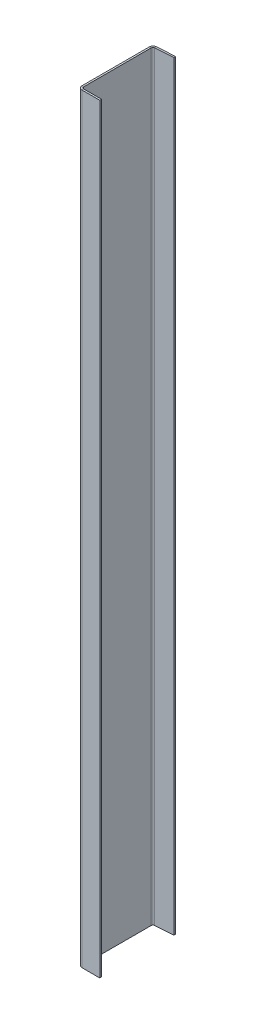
ISO-10303-21;
HEADER;
FILE_DESCRIPTION(('STEP AP214'),'2;1');
FILE_NAME('part.step','',(''),(''),'','','');
FILE_SCHEMA(('AUTOMOTIVE_DESIGN { 1 0 10303 214 1 1 1 1 }'));
ENDSEC;
DATA;
#1=APPLICATION_CONTEXT('core data for automotive mechanical design processes');
#2=APPLICATION_PROTOCOL_DEFINITION('international standard','automotive_design',2000,#1);
#3=PRODUCT_CONTEXT('',#1,'mechanical');
#4=PRODUCT('Part','Part','',(#3));
#5=PRODUCT_RELATED_PRODUCT_CATEGORY('part','',(#4));
#6=PRODUCT_DEFINITION_FORMATION('','',#4);
#7=PRODUCT_DEFINITION_CONTEXT('part definition',#1,'design');
#8=PRODUCT_DEFINITION('design','',#6,#7);
#9=PRODUCT_DEFINITION_SHAPE('','',#8);
#10=(LENGTH_UNIT() NAMED_UNIT(*) SI_UNIT(.MILLI.,.METRE.));
#11=(NAMED_UNIT(*) PLANE_ANGLE_UNIT() SI_UNIT($,.RADIAN.));
#12=(NAMED_UNIT(*) SI_UNIT($,.STERADIAN.) SOLID_ANGLE_UNIT());
#13=UNCERTAINTY_MEASURE_WITH_UNIT(LENGTH_MEASURE(1.E-05),#10,'distance_accuracy_value','');
#14=(GEOMETRIC_REPRESENTATION_CONTEXT(3) GLOBAL_UNCERTAINTY_ASSIGNED_CONTEXT((#13)) GLOBAL_UNIT_ASSIGNED_CONTEXT((#10,
#11,#12)) REPRESENTATION_CONTEXT('',''));
#15=CARTESIAN_POINT('',(0.,0.,0.));
#16=DIRECTION('',(0.,0.,1.));
#17=DIRECTION('',(1.,0.,0.));
#18=AXIS2_PLACEMENT_3D('',#15,#16,#17);
#19=CARTESIAN_POINT('',(5.99520433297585E-12,2692.40000000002,-12.6999999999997));
#20=DIRECTION('',(0.,1.00000000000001,0.));
#21=DIRECTION('',(0.,0.,1.));
#22=AXIS2_PLACEMENT_3D('',#19,#20,#21);
#23=PLANE('',#22);
#24=DIRECTION('',(1.,0.,0.));
#25=VECTOR('',#24,1.);
#26=CARTESIAN_POINT('',(5.99520433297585E-12,2692.40000000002,-12.6999999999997));
#27=LINE('',#26,#25);
#28=CARTESIAN_POINT('',(5.99520433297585E-12,2692.40000000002,-12.6999999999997));
#29=VERTEX_POINT('',#28);
#30=CARTESIAN_POINT('',(6.35000000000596,2692.40000000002,-12.6999999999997));
#31=VERTEX_POINT('',#30);
#32=EDGE_CURVE('E11',#29,#31,#27,.T.);
#33=ORIENTED_EDGE('',*,*,#32,.F.);
#34=CARTESIAN_POINT('',(12.7000000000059,2692.40000000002,-12.6999999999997));
#35=DIRECTION('',(0.,1.00000000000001,0.));
#36=DIRECTION('',(0.,0.,1.));
#37=AXIS2_PLACEMENT_3D('',#34,#35,#36);
#38=CIRCLE('',#37,12.7);
#39=CARTESIAN_POINT('',(12.700000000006,2692.40000000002,3.3133218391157E-13));
#40=VERTEX_POINT('',#39);
#41=EDGE_CURVE('E246',#40,#29,#38,.F.);
#42=ORIENTED_EDGE('',*,*,#41,.F.);
#43=DIRECTION('',(0.,0.,1.));
#44=VECTOR('',#43,1.);
#45=CARTESIAN_POINT('',(12.700000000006,2692.40000000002,-6.34999999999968));
#46=LINE('',#45,#44);
#47=CARTESIAN_POINT('',(12.700000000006,2692.40000000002,-6.34999999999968));
#48=VERTEX_POINT('',#47);
#49=EDGE_CURVE('E44',#48,#40,#46,.T.);
#50=ORIENTED_EDGE('',*,*,#49,.F.);
#51=CARTESIAN_POINT('',(12.7000000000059,2692.40000000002,-12.6999999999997));
#52=DIRECTION('',(0.,1.00000000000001,0.));
#53=DIRECTION('',(1.,0.,0.));
#54=AXIS2_PLACEMENT_3D('',#51,#52,#53);
#55=CIRCLE('',#54,6.35);
#56=EDGE_CURVE('E145',#48,#31,#55,.F.);
#57=ORIENTED_EDGE('',*,*,#56,.T.);
#58=EDGE_LOOP('',(#33,#42,#50,#57));
#59=FACE_BOUND('',#58,.T.);
#60=ADVANCED_FACE('F36',(#59),#23,.T.);
#61=CARTESIAN_POINT('',(12.700000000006,2692.40000000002,-6.34999999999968));
#62=DIRECTION('',(0.,1.00000000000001,0.));
#63=DIRECTION('',(0.,0.,1.));
#64=AXIS2_PLACEMENT_3D('',#61,#62,#63);
#65=PLANE('',#64);
#66=DIRECTION('',(0.,0.,-1.));
#67=VECTOR('',#66,1.);
#68=CARTESIAN_POINT('',(5.99520433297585E-12,2692.40000000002,3.35668992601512E-13));
#69=LINE('',#68,#67);
#70=CARTESIAN_POINT('',(5.99520433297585E-12,2692.40000000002,-251.682058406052));
#71=VERTEX_POINT('',#70);
#72=EDGE_CURVE('E139',#29,#71,#69,.T.);
#73=ORIENTED_EDGE('',*,*,#72,.F.);
#74=ORIENTED_EDGE('',*,*,#32,.T.);
#75=DIRECTION('',(0.,0.,-1.));
#76=VECTOR('',#75,1.);
#77=CARTESIAN_POINT('',(6.35000000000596,2692.40000000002,3.33717428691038E-13));
#78=LINE('',#77,#76);
#79=CARTESIAN_POINT('',(6.35000000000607,2692.40000000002,-251.682058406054));
#80=VERTEX_POINT('',#79);
#81=EDGE_CURVE('E136',#31,#80,#78,.T.);
#82=ORIENTED_EDGE('',*,*,#81,.T.);
#83=DIRECTION('',(-1.,0.,0.));
#84=VECTOR('',#83,1.);
#85=CARTESIAN_POINT('',(6.35000000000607,2692.40000000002,-251.682058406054));
#86=LINE('',#85,#84);
#87=EDGE_CURVE('E227',#80,#71,#86,.T.);
#88=ORIENTED_EDGE('',*,*,#87,.T.);
#89=EDGE_LOOP('',(#73,#74,#82,#88));
#90=FACE_BOUND('',#89,.T.);
#91=ADVANCED_FACE('F134',(#90),#65,.T.);
#92=CARTESIAN_POINT('',(12.7,0.,0.));
#93=DIRECTION('',(0.,-1.00000000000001,0.));
#94=DIRECTION('',(0.,0.,-1.));
#95=AXIS2_PLACEMENT_3D('',#92,#93,#94);
#96=PLANE('',#95);
#97=DIRECTION('',(0.,0.,-1.));
#98=VECTOR('',#97,1.);
#99=CARTESIAN_POINT('',(12.7,0.,0.));
#100=LINE('',#99,#98);
#101=CARTESIAN_POINT('',(12.7,0.,0.));
#102=VERTEX_POINT('',#101);
#103=CARTESIAN_POINT('',(12.7,0.,-6.35000000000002));
#104=VERTEX_POINT('',#103);
#105=EDGE_CURVE('E232',#102,#104,#100,.T.);
#106=ORIENTED_EDGE('',*,*,#105,.F.);
#107=CARTESIAN_POINT('',(12.6999999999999,0.,-12.7));
#108=DIRECTION('',(0.,1.00000000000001,0.));
#109=DIRECTION('',(0.,0.,1.));
#110=AXIS2_PLACEMENT_3D('',#107,#108,#109);
#111=CIRCLE('',#110,12.7);
#112=CARTESIAN_POINT('',(0.,0.,-12.7));
#113=VERTEX_POINT('',#112);
#114=EDGE_CURVE('E184',#102,#113,#111,.F.);
#115=ORIENTED_EDGE('',*,*,#114,.T.);
#116=DIRECTION('',(-1.,0.,0.));
#117=VECTOR('',#116,1.);
#118=CARTESIAN_POINT('',(6.34999999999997,0.,-12.7));
#119=LINE('',#118,#117);
#120=CARTESIAN_POINT('',(6.34999999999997,0.,-12.7));
#121=VERTEX_POINT('',#120);
#122=EDGE_CURVE('E230',#121,#113,#119,.T.);
#123=ORIENTED_EDGE('',*,*,#122,.F.);
#124=CARTESIAN_POINT('',(12.6999999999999,0.,-12.7));
#125=DIRECTION('',(0.,1.00000000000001,0.));
#126=DIRECTION('',(1.,0.,0.));
#127=AXIS2_PLACEMENT_3D('',#124,#125,#126);
#128=CIRCLE('',#127,6.35);
#129=EDGE_CURVE('E157',#104,#121,#128,.F.);
#130=ORIENTED_EDGE('',*,*,#129,.F.);
#131=EDGE_LOOP('',(#106,#115,#123,#130));
#132=FACE_BOUND('',#131,.T.);
#133=ADVANCED_FACE('F284',(#132),#96,.T.);
#134=CARTESIAN_POINT('',(6.34999999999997,0.,-12.7));
#135=DIRECTION('',(0.,-1.00000000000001,0.));
#136=DIRECTION('',(0.,0.,-1.));
#137=AXIS2_PLACEMENT_3D('',#134,#135,#136);
#138=PLANE('',#137);
#139=DIRECTION('',(-1.,0.,0.));
#140=VECTOR('',#139,1.);
#141=CARTESIAN_POINT('',(76.2,0.,0.));
#142=LINE('',#141,#140);
#143=CARTESIAN_POINT('',(76.2,0.,0.));
#144=VERTEX_POINT('',#143);
#145=EDGE_CURVE('E187',#144,#102,#142,.T.);
#146=ORIENTED_EDGE('',*,*,#145,.T.);
#147=ORIENTED_EDGE('',*,*,#105,.T.);
#148=DIRECTION('',(-1.,0.,0.));
#149=VECTOR('',#148,1.);
#150=CARTESIAN_POINT('',(76.1999999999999,0.,-6.34999999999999));
#151=LINE('',#150,#149);
#152=CARTESIAN_POINT('',(76.1999999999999,0.,-6.34999999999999));
#153=VERTEX_POINT('',#152);
#154=EDGE_CURVE('E193',#153,#104,#151,.T.);
#155=ORIENTED_EDGE('',*,*,#154,.F.);
#156=DIRECTION('',(0.,0.,1.));
#157=VECTOR('',#156,1.);
#158=CARTESIAN_POINT('',(76.1999999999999,0.,-6.34999999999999));
#159=LINE('',#158,#157);
#160=EDGE_CURVE('E190',#153,#144,#159,.T.);
#161=ORIENTED_EDGE('',*,*,#160,.T.);
#162=EDGE_LOOP('',(#146,#147,#155,#161));
#163=FACE_BOUND('',#162,.T.);
#164=ADVANCED_FACE('F287',(#163),#138,.T.);
#165=CARTESIAN_POINT('',(11.8140927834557,2692.40000000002,-264.351121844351));
#166=DIRECTION('',(0.,1.00000000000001,0.));
#167=DIRECTION('',(0.,0.,1.));
#168=AXIS2_PLACEMENT_3D('',#165,#166,#167);
#169=PLANE('',#168);
#170=DIRECTION('',(0.0697564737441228,0.,0.997564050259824));
#171=VECTOR('',#170,1.);
#172=CARTESIAN_POINT('',(11.8140927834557,2692.40000000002,-264.351121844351));
#173=LINE('',#172,#171);
#174=CARTESIAN_POINT('',(11.8140927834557,2692.40000000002,-264.351121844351));
#175=VERTEX_POINT('',#174);
#176=CARTESIAN_POINT('',(12.2570463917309,2692.40000000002,-258.016590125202));
#177=VERTEX_POINT('',#176);
#178=EDGE_CURVE('E52',#175,#177,#173,.T.);
#179=ORIENTED_EDGE('',*,*,#178,.F.);
#180=CARTESIAN_POINT('',(12.700000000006,2692.40000000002,-251.682058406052));
#181=DIRECTION('',(0.,1.00000000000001,0.));
#182=DIRECTION('',(0.,0.,1.));
#183=AXIS2_PLACEMENT_3D('',#180,#181,#182);
#184=CIRCLE('',#183,12.7);
#185=EDGE_CURVE('E256',#71,#175,#184,.F.);
#186=ORIENTED_EDGE('',*,*,#185,.F.);
#187=ORIENTED_EDGE('',*,*,#87,.F.);
#188=CARTESIAN_POINT('',(12.700000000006,2692.40000000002,-251.682058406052));
#189=DIRECTION('',(0.,1.00000000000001,0.));
#190=DIRECTION('',(1.,0.,0.));
#191=AXIS2_PLACEMENT_3D('',#188,#189,#190);
#192=CIRCLE('',#191,6.35);
#193=EDGE_CURVE('E165',#80,#177,#192,.F.);
#194=ORIENTED_EDGE('',*,*,#193,.T.);
#195=EDGE_LOOP('',(#179,#186,#187,#194));
#196=FACE_BOUND('',#195,.T.);
#197=ADVANCED_FACE('F279',(#196),#169,.T.);
#198=CARTESIAN_POINT('',(6.35000000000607,2692.40000000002,-251.682058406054));
#199=DIRECTION('',(0.,1.00000000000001,0.));
#200=DIRECTION('',(0.,0.,1.));
#201=AXIS2_PLACEMENT_3D('',#198,#199,#200);
#202=PLANE('',#201);
#203=DIRECTION('',(0.997564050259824,0.,-0.0697564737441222));
#204=VECTOR('',#203,1.);
#205=CARTESIAN_POINT('',(5.99520433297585E-12,2692.40000000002,-263.525));
#206=LINE('',#205,#204);
#207=CARTESIAN_POINT('',(76.0143806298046,2692.40000000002,-268.840443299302));
#208=VERTEX_POINT('',#207);
#209=EDGE_CURVE('E259',#175,#208,#206,.T.);
#210=ORIENTED_EDGE('',*,*,#209,.F.);
#211=ORIENTED_EDGE('',*,*,#178,.T.);
#212=DIRECTION('',(0.997564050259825,0.,-0.0697564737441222));
#213=VECTOR('',#212,1.);
#214=CARTESIAN_POINT('',(0.442953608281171,2692.40000000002,-257.19046828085));
#215=LINE('',#214,#213);
#216=CARTESIAN_POINT('',(76.4573342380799,2692.40000000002,-262.505911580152));
#217=VERTEX_POINT('',#216);
#218=EDGE_CURVE('E106',#177,#217,#215,.T.);
#219=ORIENTED_EDGE('',*,*,#218,.T.);
#220=DIRECTION('',(0.0697564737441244,0.,0.997564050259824));
#221=VECTOR('',#220,1.);
#222=CARTESIAN_POINT('',(76.0143806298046,2692.40000000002,-268.840443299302));
#223=LINE('',#222,#221);
#224=EDGE_CURVE('E262',#208,#217,#223,.T.);
#225=ORIENTED_EDGE('',*,*,#224,.F.);
#226=EDGE_LOOP('',(#210,#211,#219,#225));
#227=FACE_BOUND('',#226,.T.);
#228=ADVANCED_FACE('F268',(#227),#202,.T.);
#229=CARTESIAN_POINT('',(0.,0.,-251.682058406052));
#230=DIRECTION('',(0.,-1.00000000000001,0.));
#231=DIRECTION('',(0.,0.,-1.));
#232=AXIS2_PLACEMENT_3D('',#229,#230,#231);
#233=PLANE('',#232);
#234=DIRECTION('',(1.,0.,0.));
#235=VECTOR('',#234,1.);
#236=CARTESIAN_POINT('',(0.,0.,-251.682058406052));
#237=LINE('',#236,#235);
#238=CARTESIAN_POINT('',(0.,0.,-251.682058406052));
#239=VERTEX_POINT('',#238);
#240=CARTESIAN_POINT('',(6.35000000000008,0.,-251.682058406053));
#241=VERTEX_POINT('',#240);
#242=EDGE_CURVE('E93',#239,#241,#237,.T.);
#243=ORIENTED_EDGE('',*,*,#242,.F.);
#244=CARTESIAN_POINT('',(12.7,0.,-251.682058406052));
#245=DIRECTION('',(0.,1.00000000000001,0.));
#246=DIRECTION('',(0.,0.,1.));
#247=AXIS2_PLACEMENT_3D('',#244,#245,#246);
#248=CIRCLE('',#247,12.7);
#249=CARTESIAN_POINT('',(11.8140927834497,0.,-264.351121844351));
#250=VERTEX_POINT('',#249);
#251=EDGE_CURVE('E180',#239,#250,#248,.F.);
#252=ORIENTED_EDGE('',*,*,#251,.T.);
#253=DIRECTION('',(-0.0697564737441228,0.,-0.997564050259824));
#254=VECTOR('',#253,1.);
#255=CARTESIAN_POINT('',(12.2570463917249,0.,-258.016590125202));
#256=LINE('',#255,#254);
#257=CARTESIAN_POINT('',(12.2570463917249,0.,-258.016590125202));
#258=VERTEX_POINT('',#257);
#259=EDGE_CURVE('E100',#258,#250,#256,.T.);
#260=ORIENTED_EDGE('',*,*,#259,.F.);
#261=CARTESIAN_POINT('',(12.7,0.,-251.682058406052));
#262=DIRECTION('',(0.,1.00000000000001,0.));
#263=DIRECTION('',(1.,0.,0.));
#264=AXIS2_PLACEMENT_3D('',#261,#262,#263);
#265=CIRCLE('',#264,6.35);
#266=EDGE_CURVE('E199',#241,#258,#265,.F.);
#267=ORIENTED_EDGE('',*,*,#266,.F.);
#268=EDGE_LOOP('',(#243,#252,#260,#267));
#269=FACE_BOUND('',#268,.T.);
#270=ADVANCED_FACE('F316',(#269),#233,.T.);
#271=CARTESIAN_POINT('',(12.2570463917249,0.,-258.016590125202));
#272=DIRECTION('',(0.,-1.00000000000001,0.));
#273=DIRECTION('',(0.,0.,-1.));
#274=AXIS2_PLACEMENT_3D('',#271,#272,#273);
#275=PLANE('',#274);
#276=DIRECTION('',(0.,0.,-1.));
#277=VECTOR('',#276,1.);
#278=CARTESIAN_POINT('',(0.,0.,0.));
#279=LINE('',#278,#277);
#280=EDGE_CURVE('E182',#113,#239,#279,.T.);
#281=ORIENTED_EDGE('',*,*,#280,.T.);
#282=ORIENTED_EDGE('',*,*,#242,.T.);
#283=DIRECTION('',(0.,0.,-1.));
#284=VECTOR('',#283,1.);
#285=CARTESIAN_POINT('',(6.34999999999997,0.,0.));
#286=LINE('',#285,#284);
#287=EDGE_CURVE('E197',#121,#241,#286,.T.);
#288=ORIENTED_EDGE('',*,*,#287,.F.);
#289=ORIENTED_EDGE('',*,*,#122,.T.);
#290=EDGE_LOOP('',(#281,#282,#288,#289));
#291=FACE_BOUND('',#290,.T.);
#292=ADVANCED_FACE('F319',(#291),#275,.T.);
#293=CARTESIAN_POINT('',(0.442953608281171,2692.40000000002,-257.19046828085));
#294=DIRECTION('',(-0.0697564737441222,0.,-0.997564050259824));
#295=DIRECTION('',(-0.997564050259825,0.,0.0697564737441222));
#296=AXIS2_PLACEMENT_3D('',#293,#294,#295);
#297=PLANE('',#296);
#298=DIRECTION('',(0.997564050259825,0.,-0.0697564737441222));
#299=VECTOR('',#298,1.);
#300=CARTESIAN_POINT('',(0.442953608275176,0.,-257.19046828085));
#301=LINE('',#300,#299);
#302=CARTESIAN_POINT('',(76.4573342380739,0.,-262.505911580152));
#303=VERTEX_POINT('',#302);
#304=EDGE_CURVE('E171',#258,#303,#301,.T.);
#305=ORIENTED_EDGE('',*,*,#304,.T.);
#306=DIRECTION('',(0.,-1.00000000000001,0.));
#307=VECTOR('',#306,1.);
#308=CARTESIAN_POINT('',(76.4573342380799,2692.40000000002,-262.505911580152));
#309=LINE('',#308,#307);
#310=EDGE_CURVE('E223',#217,#303,#309,.T.);
#311=ORIENTED_EDGE('',*,*,#310,.F.);
#312=ORIENTED_EDGE('',*,*,#218,.F.);
#313=DIRECTION('',(0.,-1.00000000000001,0.));
#314=VECTOR('',#313,1.);
#315=CARTESIAN_POINT('',(12.2570463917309,2692.40000000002,-258.016590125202));
#316=LINE('',#315,#314);
#317=EDGE_CURVE('E167',#177,#258,#316,.T.);
#318=ORIENTED_EDGE('',*,*,#317,.T.);
#319=EDGE_LOOP('',(#305,#311,#312,#318));
#320=FACE_BOUND('',#319,.T.);
#321=ADVANCED_FACE('F322',(#320),#297,.F.);
#322=CARTESIAN_POINT('',(76.0143806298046,2692.40000000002,-268.840443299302));
#323=DIRECTION('',(0.997564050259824,0.,-0.0697564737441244));
#324=DIRECTION('',(-0.0697564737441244,0.,-0.997564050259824));
#325=AXIS2_PLACEMENT_3D('',#322,#323,#324);
#326=PLANE('',#325);
#327=DIRECTION('',(0.0697564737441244,0.,0.997564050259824));
#328=VECTOR('',#327,1.);
#329=CARTESIAN_POINT('',(76.0143806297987,0.,-268.840443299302));
#330=LINE('',#329,#328);
#331=CARTESIAN_POINT('',(76.0143806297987,0.,-268.840443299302));
#332=VERTEX_POINT('',#331);
#333=EDGE_CURVE('E174',#332,#303,#330,.T.);
#334=ORIENTED_EDGE('',*,*,#333,.F.);
#335=DIRECTION('',(0.,-1.00000000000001,0.));
#336=VECTOR('',#335,1.);
#337=CARTESIAN_POINT('',(76.0143806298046,2692.40000000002,-268.840443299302));
#338=LINE('',#337,#336);
#339=EDGE_CURVE('E221',#208,#332,#338,.T.);
#340=ORIENTED_EDGE('',*,*,#339,.F.);
#341=ORIENTED_EDGE('',*,*,#224,.T.);
#342=ORIENTED_EDGE('',*,*,#310,.T.);
#343=EDGE_LOOP('',(#334,#340,#341,#342));
#344=FACE_BOUND('',#343,.T.);
#345=ADVANCED_FACE('F267',(#344),#326,.T.);
#346=CARTESIAN_POINT('',(5.99520433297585E-12,2692.40000000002,-263.525));
#347=DIRECTION('',(-0.0697564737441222,0.,-0.997564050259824));
#348=DIRECTION('',(-0.997564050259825,0.,0.0697564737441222));
#349=AXIS2_PLACEMENT_3D('',#346,#347,#348);
#350=PLANE('',#349);
#351=DIRECTION('',(0.997564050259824,0.,-0.0697564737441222));
#352=VECTOR('',#351,1.);
#353=CARTESIAN_POINT('',(0.,0.,-263.525));
#354=LINE('',#353,#352);
#355=EDGE_CURVE('E177',#250,#332,#354,.T.);
#356=ORIENTED_EDGE('',*,*,#355,.F.);
#357=DIRECTION('',(0.,-1.00000000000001,0.));
#358=VECTOR('',#357,1.);
#359=CARTESIAN_POINT('',(11.8140927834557,2692.40000000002,-264.351121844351));
#360=LINE('',#359,#358);
#361=EDGE_CURVE('E218',#175,#250,#360,.T.);
#362=ORIENTED_EDGE('',*,*,#361,.F.);
#363=ORIENTED_EDGE('',*,*,#209,.T.);
#364=ORIENTED_EDGE('',*,*,#339,.T.);
#365=EDGE_LOOP('',(#356,#362,#363,#364));
#366=FACE_BOUND('',#365,.T.);
#367=ADVANCED_FACE('F272',(#366),#350,.T.);
#368=CARTESIAN_POINT('',(12.700000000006,2692.40000000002,-251.682058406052));
#369=DIRECTION('',(0.,-1.00000000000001,0.));
#370=DIRECTION('',(0.,0.,-1.));
#371=AXIS2_PLACEMENT_3D('',#368,#369,#370);
#372=CYLINDRICAL_SURFACE('',#371,12.7);
#373=ORIENTED_EDGE('',*,*,#251,.F.);
#374=DIRECTION('',(0.,-1.00000000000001,0.));
#375=VECTOR('',#374,1.);
#376=CARTESIAN_POINT('',(5.99520433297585E-12,2692.40000000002,-251.682058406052));
#377=LINE('',#376,#375);
#378=EDGE_CURVE('E215',#71,#239,#377,.T.);
#379=ORIENTED_EDGE('',*,*,#378,.F.);
#380=ORIENTED_EDGE('',*,*,#185,.T.);
#381=ORIENTED_EDGE('',*,*,#361,.T.);
#382=EDGE_LOOP('',(#373,#379,#380,#381));
#383=FACE_BOUND('',#382,.T.);
#384=ADVANCED_FACE('F275',(#383),#372,.T.);
#385=CARTESIAN_POINT('',(5.99520433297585E-12,2692.40000000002,3.35668992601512E-13));
#386=DIRECTION('',(-1.,0.,0.));
#387=DIRECTION('',(0.,0.,1.));
#388=AXIS2_PLACEMENT_3D('',#385,#386,#387);
#389=PLANE('',#388);
#390=ORIENTED_EDGE('',*,*,#280,.F.);
#391=DIRECTION('',(0.,-1.00000000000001,0.));
#392=VECTOR('',#391,1.);
#393=CARTESIAN_POINT('',(5.99520433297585E-12,2692.40000000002,-12.6999999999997));
#394=LINE('',#393,#392);
#395=EDGE_CURVE('E212',#29,#113,#394,.T.);
#396=ORIENTED_EDGE('',*,*,#395,.F.);
#397=ORIENTED_EDGE('',*,*,#72,.T.);
#398=ORIENTED_EDGE('',*,*,#378,.T.);
#399=EDGE_LOOP('',(#390,#396,#397,#398));
#400=FACE_BOUND('',#399,.T.);
#401=ADVANCED_FACE('F282',(#400),#389,.T.);
#402=CARTESIAN_POINT('',(12.7000000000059,2692.40000000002,-12.6999999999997));
#403=DIRECTION('',(0.,-1.00000000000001,0.));
#404=DIRECTION('',(0.,0.,-1.));
#405=AXIS2_PLACEMENT_3D('',#402,#403,#404);
#406=CYLINDRICAL_SURFACE('',#405,12.7);
#407=ORIENTED_EDGE('',*,*,#114,.F.);
#408=DIRECTION('',(0.,-1.00000000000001,0.));
#409=VECTOR('',#408,1.);
#410=CARTESIAN_POINT('',(12.700000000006,2692.40000000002,3.3133218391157E-13));
#411=LINE('',#410,#409);
#412=EDGE_CURVE('E209',#40,#102,#411,.T.);
#413=ORIENTED_EDGE('',*,*,#412,.F.);
#414=ORIENTED_EDGE('',*,*,#41,.T.);
#415=ORIENTED_EDGE('',*,*,#395,.T.);
#416=EDGE_LOOP('',(#407,#413,#414,#415));
#417=FACE_BOUND('',#416,.T.);
#418=ADVANCED_FACE('F245',(#417),#406,.T.);
#419=CARTESIAN_POINT('',(76.200000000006,2692.40000000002,3.22875406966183E-13));
#420=DIRECTION('',(0.,0.,1.));
#421=DIRECTION('',(1.,0.,0.));
#422=AXIS2_PLACEMENT_3D('',#419,#420,#421);
#423=PLANE('',#422);
#424=ORIENTED_EDGE('',*,*,#145,.F.);
#425=DIRECTION('',(0.,-1.00000000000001,0.));
#426=VECTOR('',#425,1.);
#427=CARTESIAN_POINT('',(76.200000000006,2692.40000000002,3.22875406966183E-13));
#428=LINE('',#427,#426);
#429=CARTESIAN_POINT('',(76.200000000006,2692.40000000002,3.22875406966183E-13));
#430=VERTEX_POINT('',#429);
#431=EDGE_CURVE('E207',#430,#144,#428,.T.);
#432=ORIENTED_EDGE('',*,*,#431,.F.);
#433=DIRECTION('',(-1.,0.,0.));
#434=VECTOR('',#433,1.);
#435=CARTESIAN_POINT('',(76.200000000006,2692.40000000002,3.22875406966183E-13));
#436=LINE('',#435,#434);
#437=EDGE_CURVE('E239',#430,#40,#436,.T.);
#438=ORIENTED_EDGE('',*,*,#437,.T.);
#439=ORIENTED_EDGE('',*,*,#412,.T.);
#440=EDGE_LOOP('',(#424,#432,#438,#439));
#441=FACE_BOUND('',#440,.T.);
#442=ADVANCED_FACE('F250',(#441),#423,.T.);
#443=CARTESIAN_POINT('',(76.2000000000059,2692.40000000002,-6.34999999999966));
#444=DIRECTION('',(1.,0.,0.));
#445=DIRECTION('',(0.,0.,-1.));
#446=AXIS2_PLACEMENT_3D('',#443,#444,#445);
#447=PLANE('',#446);
#448=ORIENTED_EDGE('',*,*,#160,.F.);
#449=DIRECTION('',(0.,-1.00000000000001,0.));
#450=VECTOR('',#449,1.);
#451=CARTESIAN_POINT('',(76.2000000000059,2692.40000000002,-6.34999999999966));
#452=LINE('',#451,#450);
#453=CARTESIAN_POINT('',(76.2000000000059,2692.40000000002,-6.34999999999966));
#454=VERTEX_POINT('',#453);
#455=EDGE_CURVE('E205',#454,#153,#452,.T.);
#456=ORIENTED_EDGE('',*,*,#455,.F.);
#457=DIRECTION('',(0.,0.,1.));
#458=VECTOR('',#457,1.);
#459=CARTESIAN_POINT('',(76.2000000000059,2692.40000000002,-6.34999999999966));
#460=LINE('',#459,#458);
#461=EDGE_CURVE('E251',#454,#430,#460,.T.);
#462=ORIENTED_EDGE('',*,*,#461,.T.);
#463=ORIENTED_EDGE('',*,*,#431,.T.);
#464=EDGE_LOOP('',(#448,#456,#462,#463));
#465=FACE_BOUND('',#464,.T.);
#466=ADVANCED_FACE('F292',(#465),#447,.T.);
#467=CARTESIAN_POINT('',(76.2000000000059,2692.40000000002,-6.34999999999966));
#468=DIRECTION('',(0.,0.,1.));
#469=DIRECTION('',(1.,0.,0.));
#470=AXIS2_PLACEMENT_3D('',#467,#468,#469);
#471=PLANE('',#470);
#472=ORIENTED_EDGE('',*,*,#154,.T.);
#473=DIRECTION('',(0.,-1.00000000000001,0.));
#474=VECTOR('',#473,1.);
#475=CARTESIAN_POINT('',(12.700000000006,2692.40000000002,-6.34999999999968));
#476=LINE('',#475,#474);
#477=EDGE_CURVE('E159',#48,#104,#476,.T.);
#478=ORIENTED_EDGE('',*,*,#477,.F.);
#479=DIRECTION('',(-1.,0.,0.));
#480=VECTOR('',#479,1.);
#481=CARTESIAN_POINT('',(76.2000000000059,2692.40000000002,-6.34999999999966));
#482=LINE('',#481,#480);
#483=EDGE_CURVE('E150',#454,#48,#482,.T.);
#484=ORIENTED_EDGE('',*,*,#483,.F.);
#485=ORIENTED_EDGE('',*,*,#455,.T.);
#486=EDGE_LOOP('',(#472,#478,#484,#485));
#487=FACE_BOUND('',#486,.T.);
#488=ADVANCED_FACE('F290',(#487),#471,.F.);
#489=CARTESIAN_POINT('',(12.7000000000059,2692.40000000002,-12.6999999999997));
#490=DIRECTION('',(0.,-1.00000000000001,0.));
#491=DIRECTION('',(0.,0.,-1.));
#492=AXIS2_PLACEMENT_3D('',#489,#490,#491);
#493=CYLINDRICAL_SURFACE('',#492,6.35);
#494=ORIENTED_EDGE('',*,*,#129,.T.);
#495=DIRECTION('',(0.,-1.00000000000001,0.));
#496=VECTOR('',#495,1.);
#497=CARTESIAN_POINT('',(6.35000000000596,2692.40000000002,-12.6999999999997));
#498=LINE('',#497,#496);
#499=EDGE_CURVE('E154',#31,#121,#498,.T.);
#500=ORIENTED_EDGE('',*,*,#499,.F.);
#501=ORIENTED_EDGE('',*,*,#56,.F.);
#502=ORIENTED_EDGE('',*,*,#477,.T.);
#503=EDGE_LOOP('',(#494,#500,#501,#502));
#504=FACE_BOUND('',#503,.T.);
#505=ADVANCED_FACE('F155',(#504),#493,.F.);
#506=CARTESIAN_POINT('',(6.35000000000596,2692.40000000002,3.33717428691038E-13));
#507=DIRECTION('',(-1.,0.,0.));
#508=DIRECTION('',(0.,0.,1.));
#509=AXIS2_PLACEMENT_3D('',#506,#507,#508);
#510=PLANE('',#509);
#511=ORIENTED_EDGE('',*,*,#287,.T.);
#512=DIRECTION('',(0.,-1.00000000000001,0.));
#513=VECTOR('',#512,1.);
#514=CARTESIAN_POINT('',(6.35000000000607,2692.40000000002,-251.682058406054));
#515=LINE('',#514,#513);
#516=EDGE_CURVE('E160',#80,#241,#515,.T.);
#517=ORIENTED_EDGE('',*,*,#516,.F.);
#518=ORIENTED_EDGE('',*,*,#81,.F.);
#519=ORIENTED_EDGE('',*,*,#499,.T.);
#520=EDGE_LOOP('',(#511,#517,#518,#519));
#521=FACE_BOUND('',#520,.T.);
#522=ADVANCED_FACE('F162',(#521),#510,.F.);
#523=CARTESIAN_POINT('',(12.700000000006,2692.40000000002,-251.682058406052));
#524=DIRECTION('',(0.,-1.00000000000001,0.));
#525=DIRECTION('',(0.,0.,-1.));
#526=AXIS2_PLACEMENT_3D('',#523,#524,#525);
#527=CYLINDRICAL_SURFACE('',#526,6.35);
#528=ORIENTED_EDGE('',*,*,#266,.T.);
#529=ORIENTED_EDGE('',*,*,#317,.F.);
#530=ORIENTED_EDGE('',*,*,#193,.F.);
#531=ORIENTED_EDGE('',*,*,#516,.T.);
#532=EDGE_LOOP('',(#528,#529,#530,#531));
#533=FACE_BOUND('',#532,.T.);
#534=ADVANCED_FACE('F374',(#533),#527,.F.);
#535=CARTESIAN_POINT('',(12.700000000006,2692.40000000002,-251.682058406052));
#536=DIRECTION('',(0.,1.00000000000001,0.));
#537=DIRECTION('',(1.,0.,0.));
#538=AXIS2_PLACEMENT_3D('',#535,#536,#537);
#539=PLANE('',#538);
#540=ORIENTED_EDGE('',*,*,#483,.T.);
#541=ORIENTED_EDGE('',*,*,#49,.T.);
#542=ORIENTED_EDGE('',*,*,#437,.F.);
#543=ORIENTED_EDGE('',*,*,#461,.F.);
#544=EDGE_LOOP('',(#540,#541,#542,#543));
#545=FACE_BOUND('',#544,.T.);
#546=ADVANCED_FACE('F236',(#545),#539,.T.);
#547=CARTESIAN_POINT('',(12.7,0.,-251.682058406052));
#548=DIRECTION('',(0.,1.00000000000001,0.));
#549=DIRECTION('',(1.,0.,0.));
#550=AXIS2_PLACEMENT_3D('',#547,#548,#549);
#551=PLANE('',#550);
#552=ORIENTED_EDGE('',*,*,#304,.F.);
#553=ORIENTED_EDGE('',*,*,#259,.T.);
#554=ORIENTED_EDGE('',*,*,#355,.T.);
#555=ORIENTED_EDGE('',*,*,#333,.T.);
#556=EDGE_LOOP('',(#552,#553,#554,#555));
#557=FACE_BOUND('',#556,.T.);
#558=ADVANCED_FACE('F394',(#557),#551,.F.);
#559=CLOSED_SHELL('',(#60,#91,#133,#164,#197,#228,#270,#292,#321,#345,#367,#384,#401,#418,#442,
#466,#488,#505,#522,#534,#546,#558));
#560=MANIFOLD_SOLID_BREP('B2',#559);
#561=ADVANCED_BREP_SHAPE_REPRESENTATION('',(#18,#560),#14);
#562=SHAPE_DEFINITION_REPRESENTATION(#9,#561);
ENDSEC;
END-ISO-10303-21;
